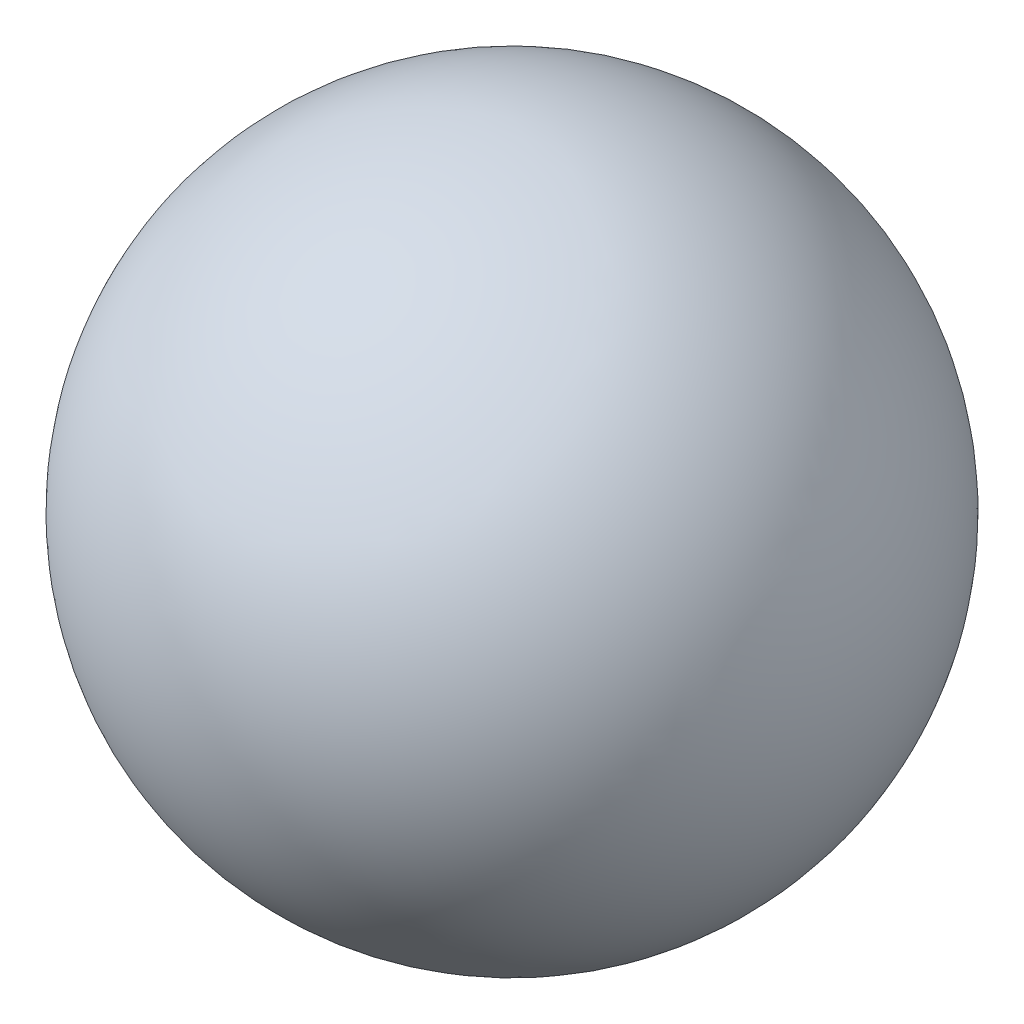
ISO-10303-21;
HEADER;
FILE_DESCRIPTION(('STEP AP214'),'2;1');
FILE_NAME('part.step','',(''),(''),'','','');
FILE_SCHEMA(('AUTOMOTIVE_DESIGN { 1 0 10303 214 1 1 1 1 }'));
ENDSEC;
DATA;
#1=APPLICATION_CONTEXT('core data for automotive mechanical design processes');
#2=APPLICATION_PROTOCOL_DEFINITION('international standard','automotive_design',2000,#1);
#3=PRODUCT_CONTEXT('',#1,'mechanical');
#4=PRODUCT('Part','Part','',(#3));
#5=PRODUCT_RELATED_PRODUCT_CATEGORY('part','',(#4));
#6=PRODUCT_DEFINITION_FORMATION('','',#4);
#7=PRODUCT_DEFINITION_CONTEXT('part definition',#1,'design');
#8=PRODUCT_DEFINITION('design','',#6,#7);
#9=PRODUCT_DEFINITION_SHAPE('','',#8);
#10=(LENGTH_UNIT() NAMED_UNIT(*) SI_UNIT(.MILLI.,.METRE.));
#11=(NAMED_UNIT(*) PLANE_ANGLE_UNIT() SI_UNIT($,.RADIAN.));
#12=(NAMED_UNIT(*) SI_UNIT($,.STERADIAN.) SOLID_ANGLE_UNIT());
#13=UNCERTAINTY_MEASURE_WITH_UNIT(LENGTH_MEASURE(1.E-05),#10,'distance_accuracy_value','');
#14=(GEOMETRIC_REPRESENTATION_CONTEXT(3) GLOBAL_UNCERTAINTY_ASSIGNED_CONTEXT((#13)) GLOBAL_UNIT_ASSIGNED_CONTEXT((#10,
#11,#12)) REPRESENTATION_CONTEXT('',''));
#15=CARTESIAN_POINT('',(0.,0.,0.));
#16=DIRECTION('',(0.,0.,1.));
#17=DIRECTION('',(1.,0.,0.));
#18=AXIS2_PLACEMENT_3D('',#15,#16,#17);
#19=CARTESIAN_POINT('',(4.99999999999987,0.,-5.25));
#20=DIRECTION('',(-1.,0.,0.));
#21=DIRECTION('',(0.,0.,-1.));
#22=AXIS2_PLACEMENT_3D('',#19,#20,#21);
#23=SPHERICAL_SURFACE('',#22,3.75);
#24=CARTESIAN_POINT('',(1.24999999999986,0.,-5.25));
#25=VERTEX_POINT('',#24);
#26=VERTEX_LOOP('',#25);
#27=FACE_BOUND('',#26,.T.);
#28=ADVANCED_FACE('F25',(#27),#23,.T.);
#29=CLOSED_SHELL('',(#28));
#30=MANIFOLD_SOLID_BREP('B2',#29);
#31=ADVANCED_BREP_SHAPE_REPRESENTATION('',(#18,#30),#14);
#32=SHAPE_DEFINITION_REPRESENTATION(#9,#31);
ENDSEC;
END-ISO-10303-21;
